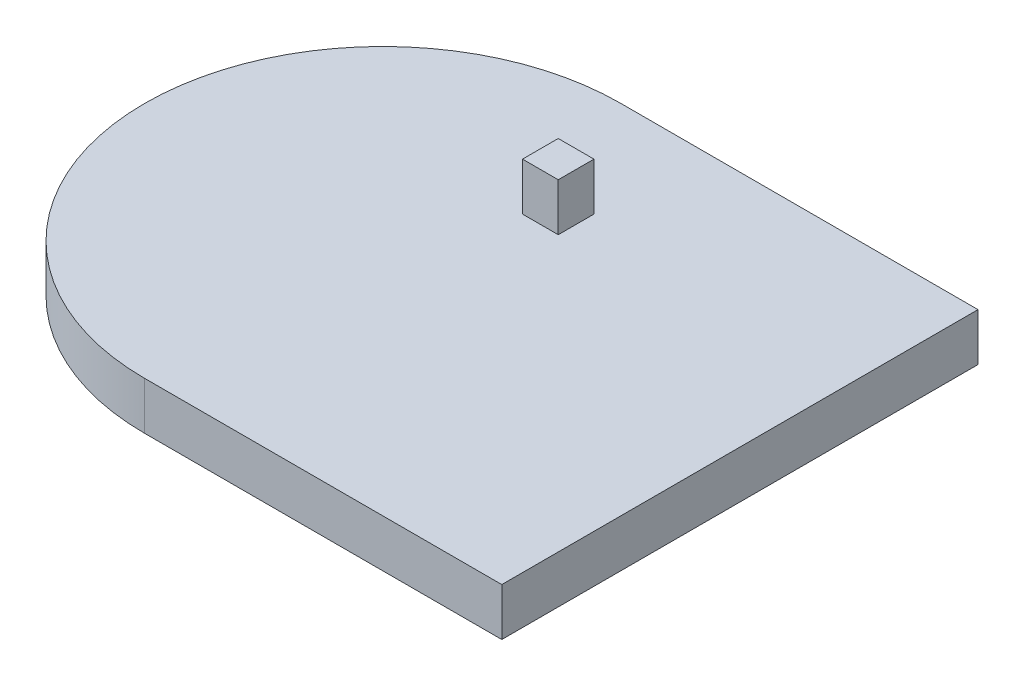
ISO-10303-21;
HEADER;
FILE_DESCRIPTION(('STEP AP214'),'2;1');
FILE_NAME('part.step','',(''),(''),'','','');
FILE_SCHEMA(('AUTOMOTIVE_DESIGN { 1 0 10303 214 1 1 1 1 }'));
ENDSEC;
DATA;
#1=APPLICATION_CONTEXT('core data for automotive mechanical design processes');
#2=APPLICATION_PROTOCOL_DEFINITION('international standard','automotive_design',2000,#1);
#3=PRODUCT_CONTEXT('',#1,'mechanical');
#4=PRODUCT('Part','Part','',(#3));
#5=PRODUCT_RELATED_PRODUCT_CATEGORY('part','',(#4));
#6=PRODUCT_DEFINITION_FORMATION('','',#4);
#7=PRODUCT_DEFINITION_CONTEXT('part definition',#1,'design');
#8=PRODUCT_DEFINITION('design','',#6,#7);
#9=PRODUCT_DEFINITION_SHAPE('','',#8);
#10=(LENGTH_UNIT() NAMED_UNIT(*) SI_UNIT(.MILLI.,.METRE.));
#11=(NAMED_UNIT(*) PLANE_ANGLE_UNIT() SI_UNIT($,.RADIAN.));
#12=(NAMED_UNIT(*) SI_UNIT($,.STERADIAN.) SOLID_ANGLE_UNIT());
#13=UNCERTAINTY_MEASURE_WITH_UNIT(LENGTH_MEASURE(1.E-05),#10,'distance_accuracy_value','');
#14=(GEOMETRIC_REPRESENTATION_CONTEXT(3) GLOBAL_UNCERTAINTY_ASSIGNED_CONTEXT((#13)) GLOBAL_UNIT_ASSIGNED_CONTEXT((#10,
#11,#12)) REPRESENTATION_CONTEXT('',''));
#15=CARTESIAN_POINT('',(0.,0.,0.));
#16=DIRECTION('',(0.,0.,1.));
#17=DIRECTION('',(1.,0.,0.));
#18=AXIS2_PLACEMENT_3D('',#15,#16,#17);
#19=CARTESIAN_POINT('',(-75.,20.,0.));
#20=DIRECTION('',(0.,1.,0.));
#21=DIRECTION('',(0.,0.,1.));
#22=AXIS2_PLACEMENT_3D('',#19,#20,#21);
#23=PLANE('',#22);
#24=CARTESIAN_POINT('',(-75.,20.,0.));
#25=DIRECTION('',(0.,1.,0.));
#26=DIRECTION('',(0.,0.,1.));
#27=AXIS2_PLACEMENT_3D('',#24,#25,#26);
#28=CIRCLE('',#27,100.);
#29=CARTESIAN_POINT('',(-75.,20.,-100.));
#30=VERTEX_POINT('',#29);
#31=CARTESIAN_POINT('',(-75.,20.,100.));
#32=VERTEX_POINT('',#31);
#33=EDGE_CURVE('E140',#30,#32,#28,.T.);
#34=ORIENTED_EDGE('',*,*,#33,.T.);
#35=DIRECTION('',(1.,0.,0.));
#36=VECTOR('',#35,1.);
#37=CARTESIAN_POINT('',(-75.,20.,100.));
#38=LINE('',#37,#36);
#39=CARTESIAN_POINT('',(75.,20.,100.));
#40=VERTEX_POINT('',#39);
#41=EDGE_CURVE('E142',#32,#40,#38,.T.);
#42=ORIENTED_EDGE('',*,*,#41,.T.);
#43=DIRECTION('',(0.,0.,-1.));
#44=VECTOR('',#43,1.);
#45=CARTESIAN_POINT('',(75.,20.,-100.));
#46=LINE('',#45,#44);
#47=CARTESIAN_POINT('',(75.,20.,-100.));
#48=VERTEX_POINT('',#47);
#49=EDGE_CURVE('E144',#40,#48,#46,.T.);
#50=ORIENTED_EDGE('',*,*,#49,.T.);
#51=DIRECTION('',(-1.,0.,0.));
#52=VECTOR('',#51,1.);
#53=CARTESIAN_POINT('',(-75.,20.,-100.));
#54=LINE('',#53,#52);
#55=EDGE_CURVE('E49',#48,#30,#54,.T.);
#56=ORIENTED_EDGE('',*,*,#55,.T.);
#57=EDGE_LOOP('',(#34,#42,#50,#56));
#58=FACE_BOUND('',#57,.T.);
#59=DIRECTION('',(1.,0.,0.));
#60=VECTOR('',#59,1.);
#61=CARTESIAN_POINT('',(-55.3825979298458,20.,-39.0899983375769));
#62=LINE('',#61,#60);
#63=CARTESIAN_POINT('',(-55.3825979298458,20.,-39.0899983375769));
#64=VERTEX_POINT('',#63);
#65=CARTESIAN_POINT('',(-40.3825979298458,20.,-39.089998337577));
#66=VERTEX_POINT('',#65);
#67=EDGE_CURVE('E97',#64,#66,#62,.T.);
#68=ORIENTED_EDGE('',*,*,#67,.F.);
#69=DIRECTION('',(0.,0.,1.));
#70=VECTOR('',#69,1.);
#71=CARTESIAN_POINT('',(-55.3825979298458,20.,-54.0899983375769));
#72=LINE('',#71,#70);
#73=CARTESIAN_POINT('',(-55.3825979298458,20.,-54.0899983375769));
#74=VERTEX_POINT('',#73);
#75=EDGE_CURVE('E108',#74,#64,#72,.T.);
#76=ORIENTED_EDGE('',*,*,#75,.F.);
#77=DIRECTION('',(-1.,0.,0.));
#78=VECTOR('',#77,1.);
#79=CARTESIAN_POINT('',(-55.3825979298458,20.,-54.0899983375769));
#80=LINE('',#79,#78);
#81=CARTESIAN_POINT('',(-40.3825979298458,20.,-54.089998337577));
#82=VERTEX_POINT('',#81);
#83=EDGE_CURVE('E118',#82,#74,#80,.T.);
#84=ORIENTED_EDGE('',*,*,#83,.F.);
#85=DIRECTION('',(0.,0.,-1.));
#86=VECTOR('',#85,1.);
#87=CARTESIAN_POINT('',(-40.3825979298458,20.,-54.089998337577));
#88=LINE('',#87,#86);
#89=EDGE_CURVE('E116',#66,#82,#88,.T.);
#90=ORIENTED_EDGE('',*,*,#89,.F.);
#91=EDGE_LOOP('',(#68,#76,#84,#90));
#92=FACE_BOUND('',#91,.T.);
#93=ADVANCED_FACE('F26',(#58,#92),#23,.T.);
#94=CARTESIAN_POINT('',(-75.,20.,0.));
#95=DIRECTION('',(0.,-1.,0.));
#96=DIRECTION('',(0.,0.,-1.));
#97=AXIS2_PLACEMENT_3D('',#94,#95,#96);
#98=CYLINDRICAL_SURFACE('',#97,100.);
#99=CARTESIAN_POINT('',(-75.,0.,0.));
#100=DIRECTION('',(0.,1.,0.));
#101=DIRECTION('',(0.,0.,1.));
#102=AXIS2_PLACEMENT_3D('',#99,#100,#101);
#103=CIRCLE('',#102,100.);
#104=CARTESIAN_POINT('',(-75.,0.,-100.));
#105=VERTEX_POINT('',#104);
#106=CARTESIAN_POINT('',(-75.,0.,100.));
#107=VERTEX_POINT('',#106);
#108=EDGE_CURVE('E103',#105,#107,#103,.T.);
#109=ORIENTED_EDGE('',*,*,#108,.T.);
#110=DIRECTION('',(0.,-1.,0.));
#111=VECTOR('',#110,1.);
#112=CARTESIAN_POINT('',(-75.,20.,100.));
#113=LINE('',#112,#111);
#114=EDGE_CURVE('E11',#32,#107,#113,.T.);
#115=ORIENTED_EDGE('',*,*,#114,.F.);
#116=ORIENTED_EDGE('',*,*,#33,.F.);
#117=DIRECTION('',(0.,-1.,0.));
#118=VECTOR('',#117,1.);
#119=CARTESIAN_POINT('',(-75.,20.,-100.));
#120=LINE('',#119,#118);
#121=EDGE_CURVE('E147',#30,#105,#120,.T.);
#122=ORIENTED_EDGE('',*,*,#121,.T.);
#123=EDGE_LOOP('',(#109,#115,#116,#122));
#124=FACE_BOUND('',#123,.T.);
#125=ADVANCED_FACE('F28',(#124),#98,.T.);
#126=CARTESIAN_POINT('',(-75.,20.,100.));
#127=DIRECTION('',(0.,0.,-1.));
#128=DIRECTION('',(-1.,0.,0.));
#129=AXIS2_PLACEMENT_3D('',#126,#127,#128);
#130=PLANE('',#129);
#131=DIRECTION('',(1.,0.,0.));
#132=VECTOR('',#131,1.);
#133=CARTESIAN_POINT('',(-75.,0.,100.));
#134=LINE('',#133,#132);
#135=CARTESIAN_POINT('',(75.,0.,100.));
#136=VERTEX_POINT('',#135);
#137=EDGE_CURVE('E134',#107,#136,#134,.T.);
#138=ORIENTED_EDGE('',*,*,#137,.T.);
#139=DIRECTION('',(0.,-1.,0.));
#140=VECTOR('',#139,1.);
#141=CARTESIAN_POINT('',(75.,20.,100.));
#142=LINE('',#141,#140);
#143=EDGE_CURVE('E34',#40,#136,#142,.T.);
#144=ORIENTED_EDGE('',*,*,#143,.F.);
#145=ORIENTED_EDGE('',*,*,#41,.F.);
#146=ORIENTED_EDGE('',*,*,#114,.T.);
#147=EDGE_LOOP('',(#138,#144,#145,#146));
#148=FACE_BOUND('',#147,.T.);
#149=ADVANCED_FACE('F169',(#148),#130,.F.);
#150=CARTESIAN_POINT('',(75.,20.,-100.));
#151=DIRECTION('',(-1.,0.,0.));
#152=DIRECTION('',(0.,0.,1.));
#153=AXIS2_PLACEMENT_3D('',#150,#151,#152);
#154=PLANE('',#153);
#155=DIRECTION('',(0.,0.,-1.));
#156=VECTOR('',#155,1.);
#157=CARTESIAN_POINT('',(75.,0.,-100.));
#158=LINE('',#157,#156);
#159=CARTESIAN_POINT('',(75.,0.,-100.));
#160=VERTEX_POINT('',#159);
#161=EDGE_CURVE('E136',#136,#160,#158,.T.);
#162=ORIENTED_EDGE('',*,*,#161,.T.);
#163=DIRECTION('',(0.,-1.,0.));
#164=VECTOR('',#163,1.);
#165=CARTESIAN_POINT('',(75.,20.,-100.));
#166=LINE('',#165,#164);
#167=EDGE_CURVE('E150',#48,#160,#166,.T.);
#168=ORIENTED_EDGE('',*,*,#167,.F.);
#169=ORIENTED_EDGE('',*,*,#49,.F.);
#170=ORIENTED_EDGE('',*,*,#143,.T.);
#171=EDGE_LOOP('',(#162,#168,#169,#170));
#172=FACE_BOUND('',#171,.T.);
#173=ADVANCED_FACE('F157',(#172),#154,.F.);
#174=CARTESIAN_POINT('',(-75.,20.,-100.));
#175=DIRECTION('',(0.,0.,1.));
#176=DIRECTION('',(1.,0.,0.));
#177=AXIS2_PLACEMENT_3D('',#174,#175,#176);
#178=PLANE('',#177);
#179=DIRECTION('',(-1.,0.,0.));
#180=VECTOR('',#179,1.);
#181=CARTESIAN_POINT('',(-75.,0.,-100.));
#182=LINE('',#181,#180);
#183=EDGE_CURVE('E138',#160,#105,#182,.T.);
#184=ORIENTED_EDGE('',*,*,#183,.T.);
#185=ORIENTED_EDGE('',*,*,#121,.F.);
#186=ORIENTED_EDGE('',*,*,#55,.F.);
#187=ORIENTED_EDGE('',*,*,#167,.T.);
#188=EDGE_LOOP('',(#184,#185,#186,#187));
#189=FACE_BOUND('',#188,.T.);
#190=ADVANCED_FACE('F165',(#189),#178,.F.);
#191=CARTESIAN_POINT('',(-75.,0.,0.));
#192=DIRECTION('',(0.,1.,0.));
#193=DIRECTION('',(0.,0.,1.));
#194=AXIS2_PLACEMENT_3D('',#191,#192,#193);
#195=PLANE('',#194);
#196=ORIENTED_EDGE('',*,*,#108,.F.);
#197=ORIENTED_EDGE('',*,*,#183,.F.);
#198=ORIENTED_EDGE('',*,*,#161,.F.);
#199=ORIENTED_EDGE('',*,*,#137,.F.);
#200=EDGE_LOOP('',(#196,#197,#198,#199));
#201=FACE_BOUND('',#200,.T.);
#202=ADVANCED_FACE('F163',(#201),#195,.F.);
#203=CARTESIAN_POINT('',(-55.3825979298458,40.,-54.0899983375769));
#204=DIRECTION('',(1.,0.,0.));
#205=DIRECTION('',(0.,0.,-1.));
#206=AXIS2_PLACEMENT_3D('',#203,#204,#205);
#207=PLANE('',#206);
#208=ORIENTED_EDGE('',*,*,#75,.T.);
#209=DIRECTION('',(0.,-1.,0.));
#210=VECTOR('',#209,1.);
#211=CARTESIAN_POINT('',(-55.3825979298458,40.,-39.0899983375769));
#212=LINE('',#211,#210);
#213=CARTESIAN_POINT('',(-55.3825979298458,40.,-39.0899983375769));
#214=VERTEX_POINT('',#213);
#215=EDGE_CURVE('E92',#214,#64,#212,.T.);
#216=ORIENTED_EDGE('',*,*,#215,.F.);
#217=DIRECTION('',(0.,0.,1.));
#218=VECTOR('',#217,1.);
#219=CARTESIAN_POINT('',(-55.3825979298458,40.,-54.0899983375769));
#220=LINE('',#219,#218);
#221=CARTESIAN_POINT('',(-55.3825979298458,40.,-54.0899983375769));
#222=VERTEX_POINT('',#221);
#223=EDGE_CURVE('E122',#222,#214,#220,.T.);
#224=ORIENTED_EDGE('',*,*,#223,.F.);
#225=DIRECTION('',(0.,-1.,0.));
#226=VECTOR('',#225,1.);
#227=CARTESIAN_POINT('',(-55.3825979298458,40.,-54.0899983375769));
#228=LINE('',#227,#226);
#229=EDGE_CURVE('E111',#222,#74,#228,.T.);
#230=ORIENTED_EDGE('',*,*,#229,.T.);
#231=EDGE_LOOP('',(#208,#216,#224,#230));
#232=FACE_BOUND('',#231,.T.);
#233=ADVANCED_FACE('F109',(#232),#207,.F.);
#234=CARTESIAN_POINT('',(-55.3825979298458,40.,-39.0899983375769));
#235=DIRECTION('',(0.,0.,-1.));
#236=DIRECTION('',(-1.,0.,0.));
#237=AXIS2_PLACEMENT_3D('',#234,#235,#236);
#238=PLANE('',#237);
#239=ORIENTED_EDGE('',*,*,#67,.T.);
#240=DIRECTION('',(0.,-1.,0.));
#241=VECTOR('',#240,1.);
#242=CARTESIAN_POINT('',(-40.3825979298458,40.,-39.089998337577));
#243=LINE('',#242,#241);
#244=CARTESIAN_POINT('',(-40.3825979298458,40.,-39.089998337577));
#245=VERTEX_POINT('',#244);
#246=EDGE_CURVE('E104',#245,#66,#243,.T.);
#247=ORIENTED_EDGE('',*,*,#246,.F.);
#248=DIRECTION('',(1.,0.,0.));
#249=VECTOR('',#248,1.);
#250=CARTESIAN_POINT('',(-55.3825979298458,40.,-39.0899983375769));
#251=LINE('',#250,#249);
#252=EDGE_CURVE('E99',#214,#245,#251,.T.);
#253=ORIENTED_EDGE('',*,*,#252,.F.);
#254=ORIENTED_EDGE('',*,*,#215,.T.);
#255=EDGE_LOOP('',(#239,#247,#253,#254));
#256=FACE_BOUND('',#255,.T.);
#257=ADVANCED_FACE('F94',(#256),#238,.F.);
#258=CARTESIAN_POINT('',(-40.3825979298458,40.,-54.089998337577));
#259=DIRECTION('',(-1.,0.,0.));
#260=DIRECTION('',(0.,0.,1.));
#261=AXIS2_PLACEMENT_3D('',#258,#259,#260);
#262=PLANE('',#261);
#263=ORIENTED_EDGE('',*,*,#89,.T.);
#264=DIRECTION('',(0.,-1.,0.));
#265=VECTOR('',#264,1.);
#266=CARTESIAN_POINT('',(-40.3825979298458,40.,-54.089998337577));
#267=LINE('',#266,#265);
#268=CARTESIAN_POINT('',(-40.3825979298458,40.,-54.089998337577));
#269=VERTEX_POINT('',#268);
#270=EDGE_CURVE('E41',#269,#82,#267,.T.);
#271=ORIENTED_EDGE('',*,*,#270,.F.);
#272=DIRECTION('',(0.,0.,-1.));
#273=VECTOR('',#272,1.);
#274=CARTESIAN_POINT('',(-40.3825979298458,40.,-54.089998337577));
#275=LINE('',#274,#273);
#276=EDGE_CURVE('E125',#245,#269,#275,.T.);
#277=ORIENTED_EDGE('',*,*,#276,.F.);
#278=ORIENTED_EDGE('',*,*,#246,.T.);
#279=EDGE_LOOP('',(#263,#271,#277,#278));
#280=FACE_BOUND('',#279,.T.);
#281=ADVANCED_FACE('F193',(#280),#262,.F.);
#282=CARTESIAN_POINT('',(-55.3825979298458,40.,-54.0899983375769));
#283=DIRECTION('',(0.,0.,1.));
#284=DIRECTION('',(1.,0.,0.));
#285=AXIS2_PLACEMENT_3D('',#282,#283,#284);
#286=PLANE('',#285);
#287=ORIENTED_EDGE('',*,*,#83,.T.);
#288=ORIENTED_EDGE('',*,*,#229,.F.);
#289=DIRECTION('',(-1.,0.,0.));
#290=VECTOR('',#289,1.);
#291=CARTESIAN_POINT('',(-55.3825979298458,40.,-54.0899983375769));
#292=LINE('',#291,#290);
#293=EDGE_CURVE('E127',#269,#222,#292,.T.);
#294=ORIENTED_EDGE('',*,*,#293,.F.);
#295=ORIENTED_EDGE('',*,*,#270,.T.);
#296=EDGE_LOOP('',(#287,#288,#294,#295));
#297=FACE_BOUND('',#296,.T.);
#298=ADVANCED_FACE('F198',(#297),#286,.F.);
#299=CARTESIAN_POINT('',(-55.3825979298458,40.,-39.0899983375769));
#300=DIRECTION('',(0.,1.,0.));
#301=DIRECTION('',(0.,0.,1.));
#302=AXIS2_PLACEMENT_3D('',#299,#300,#301);
#303=PLANE('',#302);
#304=ORIENTED_EDGE('',*,*,#223,.T.);
#305=ORIENTED_EDGE('',*,*,#252,.T.);
#306=ORIENTED_EDGE('',*,*,#276,.T.);
#307=ORIENTED_EDGE('',*,*,#293,.T.);
#308=EDGE_LOOP('',(#304,#305,#306,#307));
#309=FACE_BOUND('',#308,.T.);
#310=ADVANCED_FACE('F202',(#309),#303,.T.);
#311=CLOSED_SHELL('',(#93,#125,#149,#173,#190,#202,#233,#257,#281,#298,#310));
#312=MANIFOLD_SOLID_BREP('B2',#311);
#313=ADVANCED_BREP_SHAPE_REPRESENTATION('',(#18,#312),#14);
#314=SHAPE_DEFINITION_REPRESENTATION(#9,#313);
ENDSEC;
END-ISO-10303-21;
